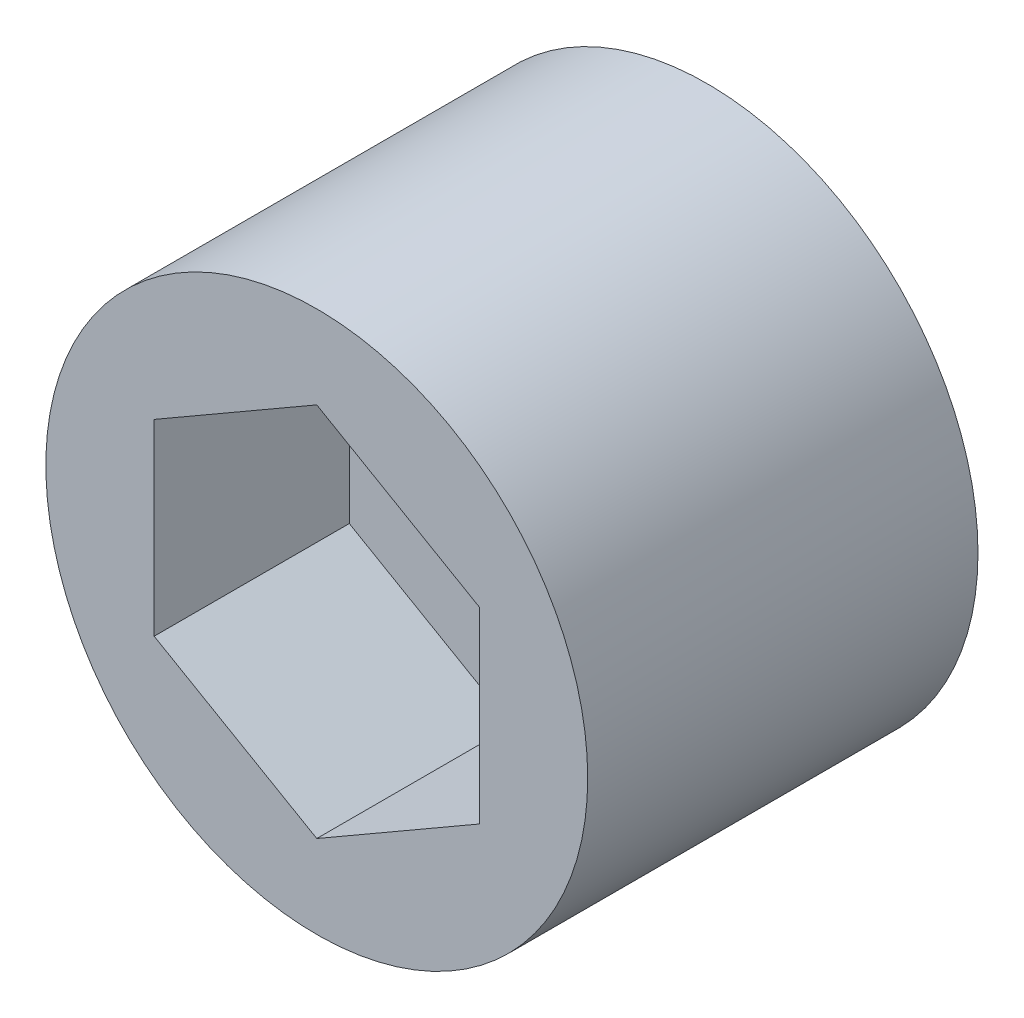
ISO-10303-21;
HEADER;
FILE_DESCRIPTION(('STEP AP214'),'2;1');
FILE_NAME('part.step','',(''),(''),'','','');
FILE_SCHEMA(('AUTOMOTIVE_DESIGN { 1 0 10303 214 1 1 1 1 }'));
ENDSEC;
DATA;
#1=APPLICATION_CONTEXT('core data for automotive mechanical design processes');
#2=APPLICATION_PROTOCOL_DEFINITION('international standard','automotive_design',2000,#1);
#3=PRODUCT_CONTEXT('',#1,'mechanical');
#4=PRODUCT('Part','Part','',(#3));
#5=PRODUCT_RELATED_PRODUCT_CATEGORY('part','',(#4));
#6=PRODUCT_DEFINITION_FORMATION('','',#4);
#7=PRODUCT_DEFINITION_CONTEXT('part definition',#1,'design');
#8=PRODUCT_DEFINITION('design','',#6,#7);
#9=PRODUCT_DEFINITION_SHAPE('','',#8);
#10=(LENGTH_UNIT() NAMED_UNIT(*) SI_UNIT(.MILLI.,.METRE.));
#11=(NAMED_UNIT(*) PLANE_ANGLE_UNIT() SI_UNIT($,.RADIAN.));
#12=(NAMED_UNIT(*) SI_UNIT($,.STERADIAN.) SOLID_ANGLE_UNIT());
#13=UNCERTAINTY_MEASURE_WITH_UNIT(LENGTH_MEASURE(1.E-05),#10,'distance_accuracy_value','');
#14=(GEOMETRIC_REPRESENTATION_CONTEXT(3) GLOBAL_UNCERTAINTY_ASSIGNED_CONTEXT((#13)) GLOBAL_UNIT_ASSIGNED_CONTEXT((#10,
#11,#12)) REPRESENTATION_CONTEXT('',''));
#15=CARTESIAN_POINT('',(0.,0.,0.));
#16=DIRECTION('',(0.,0.,1.));
#17=DIRECTION('',(1.,0.,0.));
#18=AXIS2_PLACEMENT_3D('',#15,#16,#17);
#19=CARTESIAN_POINT('',(0.,0.,12.));
#20=DIRECTION('',(0.,0.,-1.));
#21=DIRECTION('',(-1.,0.,0.));
#22=AXIS2_PLACEMENT_3D('',#19,#20,#21);
#23=CYLINDRICAL_SURFACE('',#22,8.331);
#24=CARTESIAN_POINT('',(0.,0.,12.));
#25=DIRECTION('',(0.,0.,1.));
#26=DIRECTION('',(1.,0.,0.));
#27=AXIS2_PLACEMENT_3D('',#24,#25,#26);
#28=CIRCLE('',#27,8.331);
#29=CARTESIAN_POINT('',(8.331,0.,12.));
#30=VERTEX_POINT('',#29);
#31=EDGE_CURVE('E10',#30,#30,#28,.T.);
#32=ORIENTED_EDGE('',*,*,#31,.F.);
#33=EDGE_LOOP('',(#32));
#34=FACE_BOUND('',#33,.T.);
#35=CARTESIAN_POINT('',(0.,0.,0.));
#36=DIRECTION('',(0.,0.,1.));
#37=DIRECTION('',(1.,0.,0.));
#38=AXIS2_PLACEMENT_3D('',#35,#36,#37);
#39=CIRCLE('',#38,8.331);
#40=CARTESIAN_POINT('',(8.331,0.,0.));
#41=VERTEX_POINT('',#40);
#42=EDGE_CURVE('E19',#41,#41,#39,.T.);
#43=ORIENTED_EDGE('',*,*,#42,.T.);
#44=EDGE_LOOP('',(#43));
#45=FACE_BOUND('',#44,.T.);
#46=ADVANCED_FACE('F16',(#34,#45),#23,.T.);
#47=CARTESIAN_POINT('',(0.,0.,12.));
#48=DIRECTION('',(0.,0.,1.));
#49=DIRECTION('',(1.,0.,0.));
#50=AXIS2_PLACEMENT_3D('',#47,#48,#49);
#51=PLANE('',#50);
#52=DIRECTION('',(-0.866025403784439,0.5,0.));
#53=VECTOR('',#52,1.);
#54=CARTESIAN_POINT('',(5.,2.88675134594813,12.));
#55=LINE('',#54,#53);
#56=CARTESIAN_POINT('',(5.,2.88675134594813,12.));
#57=VERTEX_POINT('',#56);
#58=CARTESIAN_POINT('',(0.,5.77350269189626,12.));
#59=VERTEX_POINT('',#58);
#60=EDGE_CURVE('E30',#57,#59,#55,.T.);
#61=ORIENTED_EDGE('',*,*,#60,.F.);
#62=DIRECTION('',(0.,1.,0.));
#63=VECTOR('',#62,1.);
#64=CARTESIAN_POINT('',(5.,-2.88675134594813,12.));
#65=LINE('',#64,#63);
#66=CARTESIAN_POINT('',(5.,-2.88675134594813,12.));
#67=VERTEX_POINT('',#66);
#68=EDGE_CURVE('E113',#67,#57,#65,.T.);
#69=ORIENTED_EDGE('',*,*,#68,.F.);
#70=DIRECTION('',(0.866025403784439,0.5,0.));
#71=VECTOR('',#70,1.);
#72=CARTESIAN_POINT('',(0.,-5.77350269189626,12.));
#73=LINE('',#72,#71);
#74=CARTESIAN_POINT('',(0.,-5.77350269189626,12.));
#75=VERTEX_POINT('',#74);
#76=EDGE_CURVE('E111',#75,#67,#73,.T.);
#77=ORIENTED_EDGE('',*,*,#76,.F.);
#78=DIRECTION('',(0.866025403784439,-0.5,0.));
#79=VECTOR('',#78,1.);
#80=CARTESIAN_POINT('',(-5.,-2.88675134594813,12.));
#81=LINE('',#80,#79);
#82=CARTESIAN_POINT('',(-5.,-2.88675134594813,12.));
#83=VERTEX_POINT('',#82);
#84=EDGE_CURVE('E78',#83,#75,#81,.T.);
#85=ORIENTED_EDGE('',*,*,#84,.F.);
#86=DIRECTION('',(0.,-1.,0.));
#87=VECTOR('',#86,1.);
#88=CARTESIAN_POINT('',(-5.,2.88675134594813,12.));
#89=LINE('',#88,#87);
#90=CARTESIAN_POINT('',(-5.,2.88675134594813,12.));
#91=VERTEX_POINT('',#90);
#92=EDGE_CURVE('E107',#91,#83,#89,.T.);
#93=ORIENTED_EDGE('',*,*,#92,.F.);
#94=DIRECTION('',(-0.866025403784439,-0.5,0.));
#95=VECTOR('',#94,1.);
#96=CARTESIAN_POINT('',(0.,5.77350269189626,12.));
#97=LINE('',#96,#95);
#98=EDGE_CURVE('E104',#59,#91,#97,.T.);
#99=ORIENTED_EDGE('',*,*,#98,.F.);
#100=EDGE_LOOP('',(#61,#69,#77,#85,#93,#99));
#101=FACE_BOUND('',#100,.T.);
#102=ORIENTED_EDGE('',*,*,#31,.T.);
#103=EDGE_LOOP('',(#102));
#104=FACE_BOUND('',#103,.T.);
#105=ADVANCED_FACE('F126',(#101,#104),#51,.T.);
#106=CARTESIAN_POINT('',(0.,0.,0.));
#107=DIRECTION('',(0.,0.,1.));
#108=DIRECTION('',(1.,0.,0.));
#109=AXIS2_PLACEMENT_3D('',#106,#107,#108);
#110=PLANE('',#109);
#111=ORIENTED_EDGE('',*,*,#42,.F.);
#112=EDGE_LOOP('',(#111));
#113=FACE_BOUND('',#112,.T.);
#114=ADVANCED_FACE('F135',(#113),#110,.F.);
#115=CARTESIAN_POINT('',(5.,2.88675134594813,6.));
#116=DIRECTION('',(0.5,0.866025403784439,0.));
#117=DIRECTION('',(-0.866025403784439,0.5,0.));
#118=AXIS2_PLACEMENT_3D('',#115,#116,#117);
#119=PLANE('',#118);
#120=ORIENTED_EDGE('',*,*,#60,.T.);
#121=DIRECTION('',(0.,0.,1.));
#122=VECTOR('',#121,1.);
#123=CARTESIAN_POINT('',(0.,5.77350269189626,6.));
#124=LINE('',#123,#122);
#125=CARTESIAN_POINT('',(0.,5.77350269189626,6.));
#126=VERTEX_POINT('',#125);
#127=EDGE_CURVE('E60',#126,#59,#124,.T.);
#128=ORIENTED_EDGE('',*,*,#127,.F.);
#129=DIRECTION('',(-0.866025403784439,0.5,0.));
#130=VECTOR('',#129,1.);
#131=CARTESIAN_POINT('',(5.,2.88675134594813,6.));
#132=LINE('',#131,#130);
#133=CARTESIAN_POINT('',(5.,2.88675134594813,6.));
#134=VERTEX_POINT('',#133);
#135=EDGE_CURVE('E115',#134,#126,#132,.T.);
#136=ORIENTED_EDGE('',*,*,#135,.F.);
#137=DIRECTION('',(0.,0.,1.));
#138=VECTOR('',#137,1.);
#139=CARTESIAN_POINT('',(5.,2.88675134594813,6.));
#140=LINE('',#139,#138);
#141=EDGE_CURVE('E38',#134,#57,#140,.T.);
#142=ORIENTED_EDGE('',*,*,#141,.T.);
#143=EDGE_LOOP('',(#120,#128,#136,#142));
#144=FACE_BOUND('',#143,.T.);
#145=ADVANCED_FACE('F132',(#144),#119,.F.);
#146=CARTESIAN_POINT('',(5.,-2.88675134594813,6.));
#147=DIRECTION('',(1.,0.,0.));
#148=DIRECTION('',(0.,0.,-1.));
#149=AXIS2_PLACEMENT_3D('',#146,#147,#148);
#150=PLANE('',#149);
#151=ORIENTED_EDGE('',*,*,#68,.T.);
#152=ORIENTED_EDGE('',*,*,#141,.F.);
#153=DIRECTION('',(0.,1.,0.));
#154=VECTOR('',#153,1.);
#155=CARTESIAN_POINT('',(5.,-2.88675134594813,6.));
#156=LINE('',#155,#154);
#157=CARTESIAN_POINT('',(5.,-2.88675134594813,6.));
#158=VERTEX_POINT('',#157);
#159=EDGE_CURVE('E90',#158,#134,#156,.T.);
#160=ORIENTED_EDGE('',*,*,#159,.F.);
#161=DIRECTION('',(0.,0.,1.));
#162=VECTOR('',#161,1.);
#163=CARTESIAN_POINT('',(5.,-2.88675134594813,6.));
#164=LINE('',#163,#162);
#165=EDGE_CURVE('E82',#158,#67,#164,.T.);
#166=ORIENTED_EDGE('',*,*,#165,.T.);
#167=EDGE_LOOP('',(#151,#152,#160,#166));
#168=FACE_BOUND('',#167,.T.);
#169=ADVANCED_FACE('F134',(#168),#150,.F.);
#170=CARTESIAN_POINT('',(0.,-5.77350269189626,6.));
#171=DIRECTION('',(0.5,-0.866025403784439,0.));
#172=DIRECTION('',(0.866025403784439,0.5,0.));
#173=AXIS2_PLACEMENT_3D('',#170,#171,#172);
#174=PLANE('',#173);
#175=ORIENTED_EDGE('',*,*,#76,.T.);
#176=ORIENTED_EDGE('',*,*,#165,.F.);
#177=DIRECTION('',(0.866025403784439,0.5,0.));
#178=VECTOR('',#177,1.);
#179=CARTESIAN_POINT('',(0.,-5.77350269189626,6.));
#180=LINE('',#179,#178);
#181=CARTESIAN_POINT('',(0.,-5.77350269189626,6.));
#182=VERTEX_POINT('',#181);
#183=EDGE_CURVE('E86',#182,#158,#180,.T.);
#184=ORIENTED_EDGE('',*,*,#183,.F.);
#185=DIRECTION('',(0.,0.,1.));
#186=VECTOR('',#185,1.);
#187=CARTESIAN_POINT('',(0.,-5.77350269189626,6.));
#188=LINE('',#187,#186);
#189=EDGE_CURVE('E71',#182,#75,#188,.T.);
#190=ORIENTED_EDGE('',*,*,#189,.T.);
#191=EDGE_LOOP('',(#175,#176,#184,#190));
#192=FACE_BOUND('',#191,.T.);
#193=ADVANCED_FACE('F87',(#192),#174,.F.);
#194=CARTESIAN_POINT('',(-5.,-2.88675134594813,6.));
#195=DIRECTION('',(-0.5,-0.866025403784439,0.));
#196=DIRECTION('',(0.866025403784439,-0.5,0.));
#197=AXIS2_PLACEMENT_3D('',#194,#195,#196);
#198=PLANE('',#197);
#199=ORIENTED_EDGE('',*,*,#84,.T.);
#200=ORIENTED_EDGE('',*,*,#189,.F.);
#201=DIRECTION('',(0.866025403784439,-0.5,0.));
#202=VECTOR('',#201,1.);
#203=CARTESIAN_POINT('',(-5.,-2.88675134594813,6.));
#204=LINE('',#203,#202);
#205=CARTESIAN_POINT('',(-5.,-2.88675134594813,6.));
#206=VERTEX_POINT('',#205);
#207=EDGE_CURVE('E75',#206,#182,#204,.T.);
#208=ORIENTED_EDGE('',*,*,#207,.F.);
#209=DIRECTION('',(0.,0.,1.));
#210=VECTOR('',#209,1.);
#211=CARTESIAN_POINT('',(-5.,-2.88675134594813,6.));
#212=LINE('',#211,#210);
#213=EDGE_CURVE('E83',#206,#83,#212,.T.);
#214=ORIENTED_EDGE('',*,*,#213,.T.);
#215=EDGE_LOOP('',(#199,#200,#208,#214));
#216=FACE_BOUND('',#215,.T.);
#217=ADVANCED_FACE('F73',(#216),#198,.F.);
#218=CARTESIAN_POINT('',(-5.,2.88675134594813,6.));
#219=DIRECTION('',(-1.,0.,0.));
#220=DIRECTION('',(0.,-1.,0.));
#221=AXIS2_PLACEMENT_3D('',#218,#219,#220);
#222=PLANE('',#221);
#223=ORIENTED_EDGE('',*,*,#92,.T.);
#224=ORIENTED_EDGE('',*,*,#213,.F.);
#225=DIRECTION('',(0.,-1.,0.));
#226=VECTOR('',#225,1.);
#227=CARTESIAN_POINT('',(-5.,2.88675134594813,6.));
#228=LINE('',#227,#226);
#229=CARTESIAN_POINT('',(-5.,2.88675134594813,6.));
#230=VERTEX_POINT('',#229);
#231=EDGE_CURVE('E96',#230,#206,#228,.T.);
#232=ORIENTED_EDGE('',*,*,#231,.F.);
#233=DIRECTION('',(0.,0.,1.));
#234=VECTOR('',#233,1.);
#235=CARTESIAN_POINT('',(-5.,2.88675134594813,6.));
#236=LINE('',#235,#234);
#237=EDGE_CURVE('E119',#230,#91,#236,.T.);
#238=ORIENTED_EDGE('',*,*,#237,.T.);
#239=EDGE_LOOP('',(#223,#224,#232,#238));
#240=FACE_BOUND('',#239,.T.);
#241=ADVANCED_FACE('F130',(#240),#222,.F.);
#242=CARTESIAN_POINT('',(0.,5.77350269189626,6.));
#243=DIRECTION('',(-0.5,0.866025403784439,0.));
#244=DIRECTION('',(-0.866025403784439,-0.5,0.));
#245=AXIS2_PLACEMENT_3D('',#242,#243,#244);
#246=PLANE('',#245);
#247=ORIENTED_EDGE('',*,*,#98,.T.);
#248=ORIENTED_EDGE('',*,*,#237,.F.);
#249=DIRECTION('',(-0.866025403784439,-0.5,0.));
#250=VECTOR('',#249,1.);
#251=CARTESIAN_POINT('',(0.,5.77350269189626,6.));
#252=LINE('',#251,#250);
#253=EDGE_CURVE('E98',#126,#230,#252,.T.);
#254=ORIENTED_EDGE('',*,*,#253,.F.);
#255=ORIENTED_EDGE('',*,*,#127,.T.);
#256=EDGE_LOOP('',(#247,#248,#254,#255));
#257=FACE_BOUND('',#256,.T.);
#258=ADVANCED_FACE('F123',(#257),#246,.F.);
#259=CARTESIAN_POINT('',(0.,0.,6.));
#260=DIRECTION('',(0.,0.,1.));
#261=DIRECTION('',(1.,0.,0.));
#262=AXIS2_PLACEMENT_3D('',#259,#260,#261);
#263=PLANE('',#262);
#264=ORIENTED_EDGE('',*,*,#135,.T.);
#265=ORIENTED_EDGE('',*,*,#253,.T.);
#266=ORIENTED_EDGE('',*,*,#231,.T.);
#267=ORIENTED_EDGE('',*,*,#207,.T.);
#268=ORIENTED_EDGE('',*,*,#183,.T.);
#269=ORIENTED_EDGE('',*,*,#159,.T.);
#270=EDGE_LOOP('',(#264,#265,#266,#267,#268,#269));
#271=FACE_BOUND('',#270,.T.);
#272=ADVANCED_FACE('F93',(#271),#263,.T.);
#273=CLOSED_SHELL('',(#46,#105,#114,#145,#169,#193,#217,#241,#258,#272));
#274=MANIFOLD_SOLID_BREP('B1',#273);
#275=ADVANCED_BREP_SHAPE_REPRESENTATION('',(#18,#274),#14);
#276=SHAPE_DEFINITION_REPRESENTATION(#9,#275);
ENDSEC;
END-ISO-10303-21;
